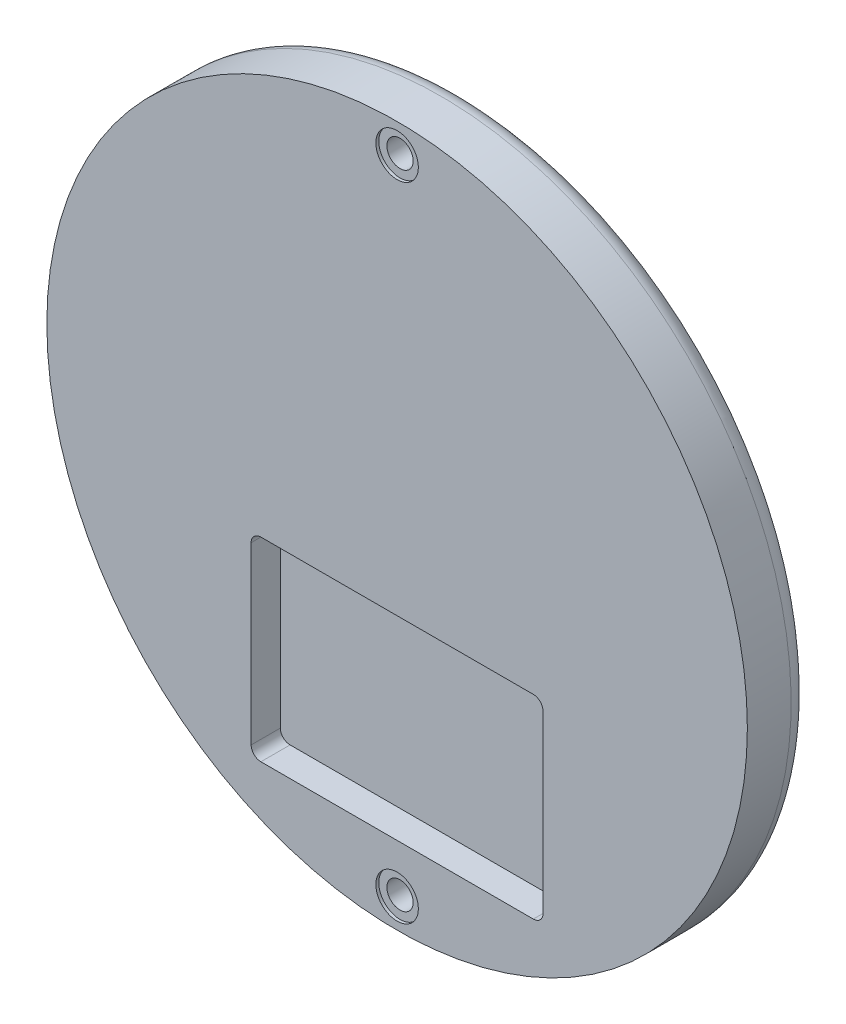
ISO-10303-21;
HEADER;
FILE_DESCRIPTION(('STEP AP214'),'2;1');
FILE_NAME('part.step','',(''),(''),'','','');
FILE_SCHEMA(('AUTOMOTIVE_DESIGN { 1 0 10303 214 1 1 1 1 }'));
ENDSEC;
DATA;
#1=APPLICATION_CONTEXT('core data for automotive mechanical design processes');
#2=APPLICATION_PROTOCOL_DEFINITION('international standard','automotive_design',2000,#1);
#3=PRODUCT_CONTEXT('',#1,'mechanical');
#4=PRODUCT('Part','Part','',(#3));
#5=PRODUCT_RELATED_PRODUCT_CATEGORY('part','',(#4));
#6=PRODUCT_DEFINITION_FORMATION('','',#4);
#7=PRODUCT_DEFINITION_CONTEXT('part definition',#1,'design');
#8=PRODUCT_DEFINITION('design','',#6,#7);
#9=PRODUCT_DEFINITION_SHAPE('','',#8);
#10=(LENGTH_UNIT() NAMED_UNIT(*) SI_UNIT(.MILLI.,.METRE.));
#11=(NAMED_UNIT(*) PLANE_ANGLE_UNIT() SI_UNIT($,.RADIAN.));
#12=(NAMED_UNIT(*) SI_UNIT($,.STERADIAN.) SOLID_ANGLE_UNIT());
#13=UNCERTAINTY_MEASURE_WITH_UNIT(LENGTH_MEASURE(1.E-05),#10,'distance_accuracy_value','');
#14=(GEOMETRIC_REPRESENTATION_CONTEXT(3) GLOBAL_UNCERTAINTY_ASSIGNED_CONTEXT((#13)) GLOBAL_UNIT_ASSIGNED_CONTEXT((#10,
#11,#12)) REPRESENTATION_CONTEXT('',''));
#15=CARTESIAN_POINT('',(0.,0.,0.));
#16=DIRECTION('',(0.,0.,1.));
#17=DIRECTION('',(1.,0.,0.));
#18=AXIS2_PLACEMENT_3D('',#15,#16,#17);
#19=CARTESIAN_POINT('',(0.,33.,0.));
#20=DIRECTION('',(0.,0.,-1.));
#21=DIRECTION('',(-1.,0.,0.));
#22=AXIS2_PLACEMENT_3D('',#19,#20,#21);
#23=CYLINDRICAL_SURFACE('',#22,1.349999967);
#24=CARTESIAN_POINT('',(0.,33.,1.13277999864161));
#25=DIRECTION('',(0.,0.,-1.));
#26=DIRECTION('',(-1.,0.,0.));
#27=AXIS2_PLACEMENT_3D('',#24,#25,#26);
#28=CIRCLE('',#27,1.349999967);
#29=CARTESIAN_POINT('',(-1.349999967,33.,1.13277999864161));
#30=VERTEX_POINT('',#29);
#31=EDGE_CURVE('E197',#30,#30,#28,.T.);
#32=ORIENTED_EDGE('',*,*,#31,.T.);
#33=EDGE_LOOP('',(#32));
#34=FACE_BOUND('',#33,.T.);
#35=CARTESIAN_POINT('',(0.,33.,6.2));
#36=DIRECTION('',(0.,0.,1.));
#37=DIRECTION('',(1.,0.,0.));
#38=AXIS2_PLACEMENT_3D('',#35,#36,#37);
#39=CIRCLE('',#38,1.349999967);
#40=CARTESIAN_POINT('',(1.349999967,33.,6.2));
#41=VERTEX_POINT('',#40);
#42=EDGE_CURVE('E191',#41,#41,#39,.F.);
#43=ORIENTED_EDGE('',*,*,#42,.F.);
#44=EDGE_LOOP('',(#43));
#45=FACE_BOUND('',#44,.T.);
#46=ADVANCED_FACE('F37',(#34,#45),#23,.F.);
#47=CARTESIAN_POINT('',(0.,-33.,0.));
#48=DIRECTION('',(0.,0.,-1.));
#49=DIRECTION('',(-1.,0.,0.));
#50=AXIS2_PLACEMENT_3D('',#47,#48,#49);
#51=CYLINDRICAL_SURFACE('',#50,1.349999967);
#52=CARTESIAN_POINT('',(0.,-33.,1.13277999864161));
#53=DIRECTION('',(0.,0.,-1.));
#54=DIRECTION('',(-1.,0.,0.));
#55=AXIS2_PLACEMENT_3D('',#52,#53,#54);
#56=CIRCLE('',#55,1.349999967);
#57=CARTESIAN_POINT('',(-1.349999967,-33.,1.13277999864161));
#58=VERTEX_POINT('',#57);
#59=EDGE_CURVE('E209',#58,#58,#56,.T.);
#60=ORIENTED_EDGE('',*,*,#59,.T.);
#61=EDGE_LOOP('',(#60));
#62=FACE_BOUND('',#61,.T.);
#63=CARTESIAN_POINT('',(0.,-33.,6.2));
#64=DIRECTION('',(0.,0.,1.));
#65=DIRECTION('',(1.,0.,0.));
#66=AXIS2_PLACEMENT_3D('',#63,#64,#65);
#67=CIRCLE('',#66,1.349999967);
#68=CARTESIAN_POINT('',(1.349999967,-33.,6.2));
#69=VERTEX_POINT('',#68);
#70=EDGE_CURVE('E204',#69,#69,#67,.F.);
#71=ORIENTED_EDGE('',*,*,#70,.F.);
#72=EDGE_LOOP('',(#71));
#73=FACE_BOUND('',#72,.T.);
#74=ADVANCED_FACE('F240',(#62,#73),#51,.F.);
#75=CARTESIAN_POINT('',(0.,0.,6.5));
#76=DIRECTION('',(0.,0.,-1.));
#77=DIRECTION('',(-1.,0.,0.));
#78=AXIS2_PLACEMENT_3D('',#75,#76,#77);
#79=CYLINDRICAL_SURFACE('',#78,36.);
#80=CARTESIAN_POINT('',(0.,0.,2.));
#81=DIRECTION('',(0.,0.,1.));
#82=DIRECTION('',(1.,0.,0.));
#83=AXIS2_PLACEMENT_3D('',#80,#81,#82);
#84=CIRCLE('',#83,36.);
#85=CARTESIAN_POINT('',(-36.,0.,2.));
#86=VERTEX_POINT('',#85);
#87=EDGE_CURVE('E215',#86,#86,#84,.T.);
#88=CARTESIAN_POINT('',(0.,0.,6.5));
#89=DIRECTION('',(0.,0.,1.));
#90=DIRECTION('',(1.,0.,0.));
#91=AXIS2_PLACEMENT_3D('',#88,#89,#90);
#92=CIRCLE('',#91,36.);
#93=CARTESIAN_POINT('',(-36.,0.,6.5));
#94=VERTEX_POINT('',#93);
#95=EDGE_CURVE('E212',#94,#94,#92,.T.);
#96=CARTESIAN_POINT('',(-36.,0.,2.));
#97=CARTESIAN_POINT('',(-36.,0.,2.046875));
#98=CARTESIAN_POINT('',(-36.,0.,2.09375));
#99=CARTESIAN_POINT('',(-36.,0.,2.1875));
#100=CARTESIAN_POINT('',(-36.,0.,2.234375));
#101=CARTESIAN_POINT('',(-36.,0.,2.328125));
#102=CARTESIAN_POINT('',(-36.,0.,2.375));
#103=CARTESIAN_POINT('',(-36.,0.,2.46875));
#104=CARTESIAN_POINT('',(-36.,0.,2.515625));
#105=CARTESIAN_POINT('',(-36.,0.,2.609375));
#106=CARTESIAN_POINT('',(-36.,0.,2.65625));
#107=CARTESIAN_POINT('',(-36.,0.,2.75));
#108=CARTESIAN_POINT('',(-36.,0.,2.796875));
#109=CARTESIAN_POINT('',(-36.,0.,2.890625));
#110=CARTESIAN_POINT('',(-36.,0.,2.9375));
#111=CARTESIAN_POINT('',(-36.,0.,3.03125));
#112=CARTESIAN_POINT('',(-36.,0.,3.078125));
#113=CARTESIAN_POINT('',(-36.,0.,3.171875));
#114=CARTESIAN_POINT('',(-36.,0.,3.21875));
#115=CARTESIAN_POINT('',(-36.,0.,3.3125));
#116=CARTESIAN_POINT('',(-36.,0.,3.359375));
#117=CARTESIAN_POINT('',(-36.,0.,3.453125));
#118=CARTESIAN_POINT('',(-36.,0.,3.5));
#119=CARTESIAN_POINT('',(-36.,0.,3.59375));
#120=CARTESIAN_POINT('',(-36.,0.,3.640625));
#121=CARTESIAN_POINT('',(-36.,0.,3.734375));
#122=CARTESIAN_POINT('',(-36.,0.,3.78125));
#123=CARTESIAN_POINT('',(-36.,0.,3.875));
#124=CARTESIAN_POINT('',(-36.,0.,3.921875));
#125=CARTESIAN_POINT('',(-36.,0.,4.015625));
#126=CARTESIAN_POINT('',(-36.,0.,4.0625));
#127=CARTESIAN_POINT('',(-36.,0.,4.15625));
#128=CARTESIAN_POINT('',(-36.,0.,4.203125));
#129=CARTESIAN_POINT('',(-36.,0.,4.296875));
#130=CARTESIAN_POINT('',(-36.,0.,4.34375));
#131=CARTESIAN_POINT('',(-36.,0.,4.4375));
#132=CARTESIAN_POINT('',(-36.,0.,4.484375));
#133=CARTESIAN_POINT('',(-36.,0.,4.578125));
#134=CARTESIAN_POINT('',(-36.,0.,4.625));
#135=CARTESIAN_POINT('',(-36.,0.,4.71875));
#136=CARTESIAN_POINT('',(-36.,0.,4.765625));
#137=CARTESIAN_POINT('',(-36.,0.,4.859375));
#138=CARTESIAN_POINT('',(-36.,0.,4.90625));
#139=CARTESIAN_POINT('',(-36.,0.,5.));
#140=CARTESIAN_POINT('',(-36.,0.,5.046875));
#141=CARTESIAN_POINT('',(-36.,0.,5.140625));
#142=CARTESIAN_POINT('',(-36.,0.,5.1875));
#143=CARTESIAN_POINT('',(-36.,0.,5.28125));
#144=CARTESIAN_POINT('',(-36.,0.,5.328125));
#145=CARTESIAN_POINT('',(-36.,0.,5.421875));
#146=CARTESIAN_POINT('',(-36.,0.,5.46875));
#147=CARTESIAN_POINT('',(-36.,0.,5.5625));
#148=CARTESIAN_POINT('',(-36.,0.,5.609375));
#149=CARTESIAN_POINT('',(-36.,0.,5.703125));
#150=CARTESIAN_POINT('',(-36.,0.,5.75));
#151=CARTESIAN_POINT('',(-36.,0.,5.84375));
#152=CARTESIAN_POINT('',(-36.,0.,5.890625));
#153=CARTESIAN_POINT('',(-36.,0.,5.984375));
#154=CARTESIAN_POINT('',(-36.,0.,6.03125));
#155=CARTESIAN_POINT('',(-36.,0.,6.125));
#156=CARTESIAN_POINT('',(-36.,0.,6.171875));
#157=CARTESIAN_POINT('',(-36.,0.,6.265625));
#158=CARTESIAN_POINT('',(-36.,0.,6.3125));
#159=CARTESIAN_POINT('',(-36.,0.,6.40625));
#160=CARTESIAN_POINT('',(-36.,0.,6.453125));
#161=CARTESIAN_POINT('',(-36.,0.,6.5));
#162=B_SPLINE_CURVE_WITH_KNOTS('',3,(#96,#97,#98,#99,#100,#101,#102,#103,#104,#105,#106,#107,
#108,#109,#110,#111,#112,#113,#114,#115,#116,#117,#118,#119,#120,#121,#122,#123,#124,#125,#126,
#127,#128,#129,#130,#131,#132,#133,#134,#135,#136,#137,#138,#139,#140,#141,#142,#143,#144,#145,
#146,#147,#148,#149,#150,#151,#152,#153,#154,#155,#156,#157,#158,#159,#160,#161),.UNSPECIFIED.,
.F.,.F.,(4,2,2,2,2,2,2,2,2,2,2,2,2,2,2,2,2,2,2,2,2,2,2,2,2,2,2,2,2,2,2,2,4),(0.,0.140625,
0.28125,0.421875,0.5625,0.703125,0.843749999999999,0.984375,1.125,1.265625,1.40625,1.546875,
1.6875,1.828125,1.96875,2.109375,2.25,2.390625,2.53125,2.671875,2.8125,2.953125,3.09375,
3.234375,3.375,3.515625,3.65625,3.796875,3.9375,4.078125,4.21875,4.359375,4.5),.UNSPECIFIED.);
#163=EDGE_CURVE('BSEAM243',#86,#94,#162,.T.);
#164=ORIENTED_EDGE('',*,*,#87,.T.);
#165=ORIENTED_EDGE('',*,*,#95,.F.);
#166=ORIENTED_EDGE('',*,*,#163,.T.);
#167=ORIENTED_EDGE('',*,*,#163,.F.);
#168=EDGE_LOOP('',(#164,#166,#165,#167));
#169=FACE_BOUND('',#168,.T.);
#170=ADVANCED_FACE('F243',(#169),#79,.T.);
#171=CARTESIAN_POINT('',(0.,0.,6.5));
#172=DIRECTION('',(0.,0.,1.));
#173=DIRECTION('',(1.,0.,0.));
#174=AXIS2_PLACEMENT_3D('',#171,#172,#173);
#175=PLANE('',#174);
#176=CARTESIAN_POINT('',(14.,-9.,6.5));
#177=DIRECTION('',(0.,0.,1.));
#178=DIRECTION('',(-1.,0.,0.));
#179=AXIS2_PLACEMENT_3D('',#176,#177,#178);
#180=CIRCLE('',#179,1.);
#181=CARTESIAN_POINT('',(15.,-9.,6.5));
#182=VERTEX_POINT('',#181);
#183=CARTESIAN_POINT('',(14.,-8.,6.5));
#184=VERTEX_POINT('',#183);
#185=EDGE_CURVE('E57',#182,#184,#180,.T.);
#186=ORIENTED_EDGE('',*,*,#185,.F.);
#187=DIRECTION('',(0.,1.,0.));
#188=VECTOR('',#187,1.);
#189=CARTESIAN_POINT('',(15.,-9.,6.5));
#190=LINE('',#189,#188);
#191=CARTESIAN_POINT('',(15.,-27.,6.5));
#192=VERTEX_POINT('',#191);
#193=EDGE_CURVE('E138',#192,#182,#190,.T.);
#194=ORIENTED_EDGE('',*,*,#193,.F.);
#195=CARTESIAN_POINT('',(14.,-27.,6.5));
#196=DIRECTION('',(0.,0.,1.));
#197=DIRECTION('',(-1.,0.,0.));
#198=AXIS2_PLACEMENT_3D('',#195,#196,#197);
#199=CIRCLE('',#198,1.);
#200=CARTESIAN_POINT('',(14.,-28.,6.5));
#201=VERTEX_POINT('',#200);
#202=EDGE_CURVE('E141',#201,#192,#199,.T.);
#203=ORIENTED_EDGE('',*,*,#202,.F.);
#204=DIRECTION('',(1.,0.,0.));
#205=VECTOR('',#204,1.);
#206=CARTESIAN_POINT('',(14.,-28.,6.5));
#207=LINE('',#206,#205);
#208=CARTESIAN_POINT('',(-14.,-28.,6.5));
#209=VERTEX_POINT('',#208);
#210=EDGE_CURVE('E169',#209,#201,#207,.T.);
#211=ORIENTED_EDGE('',*,*,#210,.F.);
#212=CARTESIAN_POINT('',(-14.,-27.,6.5));
#213=DIRECTION('',(0.,0.,1.));
#214=DIRECTION('',(-1.,0.,0.));
#215=AXIS2_PLACEMENT_3D('',#212,#213,#214);
#216=CIRCLE('',#215,0.999999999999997);
#217=CARTESIAN_POINT('',(-15.,-27.,6.5));
#218=VERTEX_POINT('',#217);
#219=EDGE_CURVE('E166',#218,#209,#216,.T.);
#220=ORIENTED_EDGE('',*,*,#219,.F.);
#221=DIRECTION('',(0.,-1.,0.));
#222=VECTOR('',#221,1.);
#223=CARTESIAN_POINT('',(-15.,-9.00000000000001,6.5));
#224=LINE('',#223,#222);
#225=CARTESIAN_POINT('',(-15.,-9.00000000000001,6.5));
#226=VERTEX_POINT('',#225);
#227=EDGE_CURVE('E163',#226,#218,#224,.T.);
#228=ORIENTED_EDGE('',*,*,#227,.F.);
#229=CARTESIAN_POINT('',(-14.,-9.00000000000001,6.5));
#230=DIRECTION('',(0.,0.,1.));
#231=DIRECTION('',(1.,0.,0.));
#232=AXIS2_PLACEMENT_3D('',#229,#230,#231);
#233=CIRCLE('',#232,1.);
#234=CARTESIAN_POINT('',(-14.,-8.,6.5));
#235=VERTEX_POINT('',#234);
#236=EDGE_CURVE('E160',#235,#226,#233,.T.);
#237=ORIENTED_EDGE('',*,*,#236,.F.);
#238=DIRECTION('',(-1.,0.,0.));
#239=VECTOR('',#238,1.);
#240=CARTESIAN_POINT('',(14.,-8.,6.5));
#241=LINE('',#240,#239);
#242=EDGE_CURVE('E158',#184,#235,#241,.T.);
#243=ORIENTED_EDGE('',*,*,#242,.F.);
#244=EDGE_LOOP('',(#186,#194,#203,#211,#220,#228,#237,#243));
#245=FACE_BOUND('',#244,.T.);
#246=CARTESIAN_POINT('',(0.,33.,6.5));
#247=DIRECTION('',(0.,0.,-1.));
#248=DIRECTION('',(1.,0.,0.));
#249=AXIS2_PLACEMENT_3D('',#246,#247,#248);
#250=CIRCLE('',#249,2.1844);
#251=CARTESIAN_POINT('',(2.1844,33.,6.5));
#252=VERTEX_POINT('',#251);
#253=EDGE_CURVE('E176',#252,#252,#250,.T.);
#254=ORIENTED_EDGE('',*,*,#253,.T.);
#255=EDGE_LOOP('',(#254));
#256=FACE_BOUND('',#255,.T.);
#257=CARTESIAN_POINT('',(0.,-33.,6.5));
#258=DIRECTION('',(0.,0.,1.));
#259=DIRECTION('',(1.,0.,0.));
#260=AXIS2_PLACEMENT_3D('',#257,#258,#259);
#261=CIRCLE('',#260,2.1844);
#262=CARTESIAN_POINT('',(2.1844,-33.,6.5));
#263=VERTEX_POINT('',#262);
#264=EDGE_CURVE('E200',#263,#263,#261,.T.);
#265=ORIENTED_EDGE('',*,*,#264,.F.);
#266=EDGE_LOOP('',(#265));
#267=FACE_BOUND('',#266,.T.);
#268=ORIENTED_EDGE('',*,*,#95,.T.);
#269=EDGE_LOOP('',(#268));
#270=FACE_BOUND('',#269,.T.);
#271=ADVANCED_FACE('F245',(#245,#256,#267,#270),#175,.T.);
#272=CARTESIAN_POINT('',(0.,0.,0.));
#273=DIRECTION('',(0.,0.,1.));
#274=DIRECTION('',(1.,0.,0.));
#275=AXIS2_PLACEMENT_3D('',#272,#273,#274);
#276=PLANE('',#275);
#277=CARTESIAN_POINT('',(0.,33.,0.));
#278=DIRECTION('',(0.,0.,-1.));
#279=DIRECTION('',(-1.,0.,0.));
#280=AXIS2_PLACEMENT_3D('',#277,#278,#279);
#281=CIRCLE('',#280,2.6999946);
#282=CARTESIAN_POINT('',(2.54391301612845,33.9046974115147,0.));
#283=VERTEX_POINT('',#282);
#284=CARTESIAN_POINT('',(-2.54391301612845,33.9046974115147,0.));
#285=VERTEX_POINT('',#284);
#286=EDGE_CURVE('E194',#283,#285,#281,.T.);
#287=ORIENTED_EDGE('',*,*,#286,.F.);
#288=CARTESIAN_POINT('',(0.,0.,0.));
#289=DIRECTION('',(0.,0.,1.));
#290=DIRECTION('',(1.,0.,0.));
#291=AXIS2_PLACEMENT_3D('',#288,#289,#290);
#292=CIRCLE('',#291,34.);
#293=CARTESIAN_POINT('',(2.54391301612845,-33.9046974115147,0.));
#294=VERTEX_POINT('',#293);
#295=EDGE_CURVE('E224',#283,#294,#292,.F.);
#296=ORIENTED_EDGE('',*,*,#295,.T.);
#297=CARTESIAN_POINT('',(0.,-33.,0.));
#298=DIRECTION('',(0.,0.,-1.));
#299=DIRECTION('',(-1.,0.,0.));
#300=AXIS2_PLACEMENT_3D('',#297,#298,#299);
#301=CIRCLE('',#300,2.6999946);
#302=CARTESIAN_POINT('',(-2.54391301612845,-33.9046974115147,0.));
#303=VERTEX_POINT('',#302);
#304=EDGE_CURVE('E207',#303,#294,#301,.T.);
#305=ORIENTED_EDGE('',*,*,#304,.F.);
#306=CARTESIAN_POINT('',(0.,0.,0.));
#307=DIRECTION('',(0.,0.,1.));
#308=DIRECTION('',(1.,0.,0.));
#309=AXIS2_PLACEMENT_3D('',#306,#307,#308);
#310=CIRCLE('',#309,34.);
#311=EDGE_CURVE('E222',#303,#285,#310,.F.);
#312=ORIENTED_EDGE('',*,*,#311,.T.);
#313=EDGE_LOOP('',(#287,#296,#305,#312));
#314=FACE_BOUND('',#313,.T.);
#315=ADVANCED_FACE('F236',(#314),#276,.F.);
#316=CARTESIAN_POINT('',(0.,-33.,0.));
#317=DIRECTION('',(0.,0.,-1.));
#318=DIRECTION('',(-1.,0.,0.));
#319=AXIS2_PLACEMENT_3D('',#316,#317,#318);
#320=CONICAL_SURFACE('',#319,2.6999946,0.872664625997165);
#321=ORIENTED_EDGE('',*,*,#59,.F.);
#322=EDGE_LOOP('',(#321));
#323=FACE_BOUND('',#322,.T.);
#324=ORIENTED_EDGE('',*,*,#304,.T.);
#325=CARTESIAN_POINT('',(2.54391301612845,-33.9046974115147,0.));
#326=CARTESIAN_POINT('',(2.53009613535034,-33.9435643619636,-4.4103825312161E-07));
#327=CARTESIAN_POINT('',(2.51420486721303,-33.9816186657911,0.00106677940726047));
#328=CARTESIAN_POINT('',(2.47885510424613,-34.0558024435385,0.00500918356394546));
#329=CARTESIAN_POINT('',(2.45940756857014,-34.0919374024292,0.0078788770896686));
#330=CARTESIAN_POINT('',(2.39708861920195,-34.1962950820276,0.0186049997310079));
#331=CARTESIAN_POINT('',(2.34978885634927,-34.2616578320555,0.0285986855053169));
#332=CARTESIAN_POINT('',(2.2286065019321,-34.405977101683,0.0563160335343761));
#333=CARTESIAN_POINT('',(2.15122545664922,-34.481629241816,0.0755221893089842));
#334=CARTESIAN_POINT('',(1.98573684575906,-34.6202609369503,0.116871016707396));
#335=CARTESIAN_POINT('',(1.89754813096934,-34.6831338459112,0.139036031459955));
#336=CARTESIAN_POINT('',(1.73572418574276,-34.7835267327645,0.178359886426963));
#337=CARTESIAN_POINT('',(1.6635799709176,-34.8235260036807,0.195462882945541));
#338=CARTESIAN_POINT('',(1.51592582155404,-34.8971635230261,0.228979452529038));
#339=CARTESIAN_POINT('',(1.44041431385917,-34.9307987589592,0.245392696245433));
#340=CARTESIAN_POINT('',(1.28682871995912,-34.99203895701,0.276761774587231));
#341=CARTESIAN_POINT('',(1.20875824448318,-35.0196520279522,0.291719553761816));
#342=CARTESIAN_POINT('',(1.05047167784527,-35.0691877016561,0.319571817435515));
#343=CARTESIAN_POINT('',(0.97025544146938,-35.0911099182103,0.332466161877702));
#344=CARTESIAN_POINT('',(0.805492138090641,-35.1300729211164,0.356020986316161));
#345=CARTESIAN_POINT('',(0.72088925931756,-35.1469304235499,0.3665945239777));
#346=CARTESIAN_POINT('',(0.550430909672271,-35.1748846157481,0.38445435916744));
#347=CARTESIAN_POINT('',(0.464575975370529,-35.1859837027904,0.391742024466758));
#348=CARTESIAN_POINT('',(0.292095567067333,-35.2024942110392,0.402680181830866));
#349=CARTESIAN_POINT('',(0.205470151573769,-35.20790606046,0.406330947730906));
#350=CARTESIAN_POINT('',(0.0319748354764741,-35.2130690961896,0.409812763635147));
#351=CARTESIAN_POINT('',(-0.0548950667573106,-35.2128202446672,0.409643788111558));
#352=CARTESIAN_POINT('',(-0.235226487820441,-35.2064159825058,0.405327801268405));
#353=CARTESIAN_POINT('',(-0.328664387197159,-35.1997937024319,0.400866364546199));
#354=CARTESIAN_POINT('',(-0.51454438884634,-35.1799155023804,0.387760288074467));
#355=CARTESIAN_POINT('',(-0.606986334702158,-35.1666585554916,0.379115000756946));
#356=CARTESIAN_POINT('',(-0.790312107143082,-35.133402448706,0.358117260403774));
#357=CARTESIAN_POINT('',(-0.881194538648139,-35.1133975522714,0.345761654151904));
#358=CARTESIAN_POINT('',(-1.06063481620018,-35.066482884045,0.318028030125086));
#359=CARTESIAN_POINT('',(-1.14919320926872,-35.0395747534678,0.302650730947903));
#360=CARTESIAN_POINT('',(-1.37259012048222,-34.9613154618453,0.260332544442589));
#361=CARTESIAN_POINT('',(-1.50538292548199,-34.9047353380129,0.231758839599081));
#362=CARTESIAN_POINT('',(-1.69650842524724,-34.805251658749,0.187674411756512));
#363=CARTESIAN_POINT('',(-1.75886400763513,-34.7696614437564,0.172778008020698));
#364=CARTESIAN_POINT('',(-1.88029728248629,-34.6932194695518,0.143176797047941));
#365=CARTESIAN_POINT('',(-1.93937677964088,-34.6523706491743,0.128471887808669));
#366=CARTESIAN_POINT('',(-2.06294593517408,-34.5576800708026,0.0975871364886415));
#367=CARTESIAN_POINT('',(-2.12669810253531,-34.5028074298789,0.0815694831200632));
#368=CARTESIAN_POINT('',(-2.24633973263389,-34.3848289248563,0.0523328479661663));
#369=CARTESIAN_POINT('',(-2.30226675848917,-34.3217654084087,0.0391003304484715));
#370=CARTESIAN_POINT('',(-2.39247896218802,-34.2014857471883,0.0197700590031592));
#371=CARTESIAN_POINT('',(-2.42882333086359,-34.1459986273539,0.0127453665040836));
#372=CARTESIAN_POINT('',(-2.49329044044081,-34.0293938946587,0.00284742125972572));
#373=CARTESIAN_POINT('',(-2.52132353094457,-33.9682236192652,1.82059352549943E-05));
#374=CARTESIAN_POINT('',(-2.54391301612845,-33.9046974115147,0.));
#375=B_SPLINE_CURVE_WITH_KNOTS('',3,(#325,#326,#327,#328,#329,#330,#331,#332,#333,#334,#335,
#336,#337,#338,#339,#340,#341,#342,#343,#344,#345,#346,#347,#348,#349,#350,#351,#352,#353,#354,
#355,#356,#357,#358,#359,#360,#361,#362,#363,#364,#365,#366,#367,#368,#369,#370,#371,#372,#373,
#374),.UNSPECIFIED.,.F.,.F.,(4,2,2,2,2,2,2,2,2,2,2,2,2,2,2,2,2,2,2,2,2,2,2,2,4),(0.,
0.123566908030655,0.24675925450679,0.489401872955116,0.81738490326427,1.14800180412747,
1.40042389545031,1.65296517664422,1.90516428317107,2.1573805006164,2.41785297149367,
2.67821691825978,2.93856125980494,3.19890734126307,3.47990082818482,3.76093782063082,
4.04221433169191,4.32342403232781,4.76311860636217,4.9828983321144,5.20255576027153,
5.45879332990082,5.71375526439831,5.91305640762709,6.11443504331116),.UNSPECIFIED.);
#376=EDGE_CURVE('E50',#294,#303,#375,.T.);
#377=ORIENTED_EDGE('',*,*,#376,.T.);
#378=EDGE_LOOP('',(#324,#377));
#379=FACE_BOUND('',#378,.T.);
#380=ADVANCED_FACE('F230',(#323,#379),#320,.F.);
#381=CARTESIAN_POINT('',(0.,-33.,6.2));
#382=DIRECTION('',(0.,0.,1.));
#383=DIRECTION('',(1.,0.,0.));
#384=AXIS2_PLACEMENT_3D('',#381,#382,#383);
#385=PLANE('',#384);
#386=CARTESIAN_POINT('',(0.,-33.,6.2));
#387=DIRECTION('',(0.,0.,1.));
#388=DIRECTION('',(1.,0.,0.));
#389=AXIS2_PLACEMENT_3D('',#386,#387,#388);
#390=CIRCLE('',#389,2.1844);
#391=CARTESIAN_POINT('',(2.1844,-33.,6.2));
#392=VERTEX_POINT('',#391);
#393=EDGE_CURVE('E201',#392,#392,#390,.T.);
#394=ORIENTED_EDGE('',*,*,#393,.T.);
#395=EDGE_LOOP('',(#394));
#396=FACE_BOUND('',#395,.T.);
#397=ORIENTED_EDGE('',*,*,#70,.T.);
#398=EDGE_LOOP('',(#397));
#399=FACE_BOUND('',#398,.T.);
#400=ADVANCED_FACE('F235',(#396,#399),#385,.T.);
#401=CARTESIAN_POINT('',(0.,-33.,6.2));
#402=DIRECTION('',(0.,0.,1.));
#403=DIRECTION('',(1.,0.,0.));
#404=AXIS2_PLACEMENT_3D('',#401,#402,#403);
#405=CYLINDRICAL_SURFACE('',#404,2.1844);
#406=ORIENTED_EDGE('',*,*,#393,.F.);
#407=EDGE_LOOP('',(#406));
#408=FACE_BOUND('',#407,.T.);
#409=ORIENTED_EDGE('',*,*,#264,.T.);
#410=EDGE_LOOP('',(#409));
#411=FACE_BOUND('',#410,.T.);
#412=ADVANCED_FACE('F238',(#408,#411),#405,.F.);
#413=CARTESIAN_POINT('',(0.,33.,0.));
#414=DIRECTION('',(0.,0.,-1.));
#415=DIRECTION('',(-1.,0.,0.));
#416=AXIS2_PLACEMENT_3D('',#413,#414,#415);
#417=CONICAL_SURFACE('',#416,2.6999946,0.872664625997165);
#418=ORIENTED_EDGE('',*,*,#31,.F.);
#419=EDGE_LOOP('',(#418));
#420=FACE_BOUND('',#419,.T.);
#421=ORIENTED_EDGE('',*,*,#286,.T.);
#422=CARTESIAN_POINT('',(-2.54391301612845,33.9046974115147,0.));
#423=CARTESIAN_POINT('',(-2.53009613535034,33.9435643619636,-4.4103825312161E-07));
#424=CARTESIAN_POINT('',(-2.51420486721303,33.9816186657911,0.00106677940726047));
#425=CARTESIAN_POINT('',(-2.47885510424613,34.0558024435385,0.00500918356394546));
#426=CARTESIAN_POINT('',(-2.45940756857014,34.0919374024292,0.0078788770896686));
#427=CARTESIAN_POINT('',(-2.39708861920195,34.1962950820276,0.0186049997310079));
#428=CARTESIAN_POINT('',(-2.34978885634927,34.2616578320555,0.0285986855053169));
#429=CARTESIAN_POINT('',(-2.2286065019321,34.405977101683,0.0563160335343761));
#430=CARTESIAN_POINT('',(-2.15122545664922,34.481629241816,0.0755221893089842));
#431=CARTESIAN_POINT('',(-1.98573684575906,34.6202609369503,0.116871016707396));
#432=CARTESIAN_POINT('',(-1.89754813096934,34.6831338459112,0.139036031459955));
#433=CARTESIAN_POINT('',(-1.73572418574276,34.7835267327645,0.178359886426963));
#434=CARTESIAN_POINT('',(-1.6635799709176,34.8235260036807,0.195462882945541));
#435=CARTESIAN_POINT('',(-1.51592582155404,34.8971635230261,0.228979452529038));
#436=CARTESIAN_POINT('',(-1.44041431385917,34.9307987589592,0.245392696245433));
#437=CARTESIAN_POINT('',(-1.28682871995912,34.99203895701,0.276761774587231));
#438=CARTESIAN_POINT('',(-1.20875824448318,35.0196520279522,0.291719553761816));
#439=CARTESIAN_POINT('',(-1.05047167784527,35.0691877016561,0.319571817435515));
#440=CARTESIAN_POINT('',(-0.97025544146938,35.0911099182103,0.332466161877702));
#441=CARTESIAN_POINT('',(-0.805492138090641,35.1300729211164,0.356020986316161));
#442=CARTESIAN_POINT('',(-0.72088925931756,35.1469304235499,0.3665945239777));
#443=CARTESIAN_POINT('',(-0.550430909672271,35.1748846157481,0.38445435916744));
#444=CARTESIAN_POINT('',(-0.464575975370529,35.1859837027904,0.391742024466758));
#445=CARTESIAN_POINT('',(-0.292095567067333,35.2024942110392,0.402680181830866));
#446=CARTESIAN_POINT('',(-0.205470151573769,35.20790606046,0.406330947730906));
#447=CARTESIAN_POINT('',(-0.0319748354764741,35.2130690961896,0.409812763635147));
#448=CARTESIAN_POINT('',(0.0548950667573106,35.2128202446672,0.409643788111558));
#449=CARTESIAN_POINT('',(0.235226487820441,35.2064159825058,0.405327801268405));
#450=CARTESIAN_POINT('',(0.328664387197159,35.1997937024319,0.400866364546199));
#451=CARTESIAN_POINT('',(0.51454438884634,35.1799155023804,0.387760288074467));
#452=CARTESIAN_POINT('',(0.606986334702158,35.1666585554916,0.379115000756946));
#453=CARTESIAN_POINT('',(0.790312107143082,35.133402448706,0.358117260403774));
#454=CARTESIAN_POINT('',(0.881194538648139,35.1133975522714,0.345761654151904));
#455=CARTESIAN_POINT('',(1.06063481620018,35.066482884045,0.318028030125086));
#456=CARTESIAN_POINT('',(1.14919320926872,35.0395747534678,0.302650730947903));
#457=CARTESIAN_POINT('',(1.37259012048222,34.9613154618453,0.260332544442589));
#458=CARTESIAN_POINT('',(1.50538292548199,34.9047353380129,0.231758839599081));
#459=CARTESIAN_POINT('',(1.69650842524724,34.805251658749,0.187674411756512));
#460=CARTESIAN_POINT('',(1.75886400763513,34.7696614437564,0.172778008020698));
#461=CARTESIAN_POINT('',(1.88029728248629,34.6932194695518,0.143176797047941));
#462=CARTESIAN_POINT('',(1.93937677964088,34.6523706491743,0.128471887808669));
#463=CARTESIAN_POINT('',(2.06294593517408,34.5576800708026,0.0975871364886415));
#464=CARTESIAN_POINT('',(2.12669810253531,34.5028074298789,0.0815694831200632));
#465=CARTESIAN_POINT('',(2.24633973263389,34.3848289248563,0.0523328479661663));
#466=CARTESIAN_POINT('',(2.30226675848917,34.3217654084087,0.0391003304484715));
#467=CARTESIAN_POINT('',(2.39247896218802,34.2014857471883,0.0197700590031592));
#468=CARTESIAN_POINT('',(2.42882333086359,34.1459986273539,0.0127453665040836));
#469=CARTESIAN_POINT('',(2.49329044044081,34.0293938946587,0.00284742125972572));
#470=CARTESIAN_POINT('',(2.52132353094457,33.9682236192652,1.82059352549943E-05));
#471=CARTESIAN_POINT('',(2.54391301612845,33.9046974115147,0.));
#472=B_SPLINE_CURVE_WITH_KNOTS('',3,(#422,#423,#424,#425,#426,#427,#428,#429,#430,#431,#432,
#433,#434,#435,#436,#437,#438,#439,#440,#441,#442,#443,#444,#445,#446,#447,#448,#449,#450,#451,
#452,#453,#454,#455,#456,#457,#458,#459,#460,#461,#462,#463,#464,#465,#466,#467,#468,#469,#470,
#471),.UNSPECIFIED.,.F.,.F.,(4,2,2,2,2,2,2,2,2,2,2,2,2,2,2,2,2,2,2,2,2,2,2,2,4),(0.,
0.123566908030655,0.24675925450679,0.489401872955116,0.81738490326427,1.14800180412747,
1.40042389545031,1.65296517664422,1.90516428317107,2.1573805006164,2.41785297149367,
2.67821691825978,2.93856125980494,3.19890734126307,3.47990082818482,3.76093782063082,
4.04221433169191,4.32342403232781,4.76311860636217,4.9828983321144,5.20255576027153,
5.45879332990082,5.71375526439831,5.91305640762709,6.11443504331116),.UNSPECIFIED.);
#473=EDGE_CURVE('E11',#285,#283,#472,.T.);
#474=ORIENTED_EDGE('',*,*,#473,.T.);
#475=EDGE_LOOP('',(#421,#474));
#476=FACE_BOUND('',#475,.T.);
#477=ADVANCED_FACE('F262',(#420,#476),#417,.F.);
#478=CARTESIAN_POINT('',(0.,33.,6.2));
#479=DIRECTION('',(0.,0.,1.));
#480=DIRECTION('',(1.,0.,0.));
#481=AXIS2_PLACEMENT_3D('',#478,#479,#480);
#482=PLANE('',#481);
#483=CARTESIAN_POINT('',(0.,33.,6.2));
#484=DIRECTION('',(0.,0.,-1.));
#485=DIRECTION('',(1.,0.,0.));
#486=AXIS2_PLACEMENT_3D('',#483,#484,#485);
#487=CIRCLE('',#486,2.1844);
#488=CARTESIAN_POINT('',(2.1844,33.,6.2));
#489=VERTEX_POINT('',#488);
#490=EDGE_CURVE('E188',#489,#489,#487,.T.);
#491=ORIENTED_EDGE('',*,*,#490,.F.);
#492=EDGE_LOOP('',(#491));
#493=FACE_BOUND('',#492,.T.);
#494=ORIENTED_EDGE('',*,*,#42,.T.);
#495=EDGE_LOOP('',(#494));
#496=FACE_BOUND('',#495,.T.);
#497=ADVANCED_FACE('F283',(#493,#496),#482,.T.);
#498=CARTESIAN_POINT('',(0.,33.,6.2));
#499=DIRECTION('',(0.,0.,1.));
#500=DIRECTION('',(1.,0.,0.));
#501=AXIS2_PLACEMENT_3D('',#498,#499,#500);
#502=CYLINDRICAL_SURFACE('',#501,2.1844);
#503=ORIENTED_EDGE('',*,*,#490,.T.);
#504=EDGE_LOOP('',(#503));
#505=FACE_BOUND('',#504,.T.);
#506=ORIENTED_EDGE('',*,*,#253,.F.);
#507=EDGE_LOOP('',(#506));
#508=FACE_BOUND('',#507,.T.);
#509=ADVANCED_FACE('F288',(#505,#508),#502,.F.);
#510=CARTESIAN_POINT('',(0.,0.,2.));
#511=DIRECTION('',(0.,0.,1.));
#512=DIRECTION('',(1.,0.,0.));
#513=AXIS2_PLACEMENT_3D('',#510,#511,#512);
#514=TOROIDAL_SURFACE('',#513,34.,2.);
#515=ORIENTED_EDGE('',*,*,#376,.F.);
#516=ORIENTED_EDGE('',*,*,#295,.F.);
#517=ORIENTED_EDGE('',*,*,#473,.F.);
#518=ORIENTED_EDGE('',*,*,#311,.F.);
#519=EDGE_LOOP('',(#515,#516,#517,#518));
#520=FACE_BOUND('',#519,.T.);
#521=ORIENTED_EDGE('',*,*,#87,.F.);
#522=EDGE_LOOP('',(#521));
#523=FACE_BOUND('',#522,.T.);
#524=ADVANCED_FACE('F39',(#520,#523),#514,.T.);
#525=CARTESIAN_POINT('',(14.,-9.,3.5));
#526=DIRECTION('',(0.,0.,1.));
#527=DIRECTION('',(1.,0.,0.));
#528=AXIS2_PLACEMENT_3D('',#525,#526,#527);
#529=CYLINDRICAL_SURFACE('',#528,1.);
#530=ORIENTED_EDGE('',*,*,#185,.T.);
#531=DIRECTION('',(0.,0.,1.));
#532=VECTOR('',#531,1.);
#533=CARTESIAN_POINT('',(14.,-8.,3.5));
#534=LINE('',#533,#532);
#535=CARTESIAN_POINT('',(14.,-8.,3.5));
#536=VERTEX_POINT('',#535);
#537=EDGE_CURVE('E115',#536,#184,#534,.T.);
#538=ORIENTED_EDGE('',*,*,#537,.F.);
#539=CARTESIAN_POINT('',(14.,-9.,3.5));
#540=DIRECTION('',(0.,0.,1.));
#541=DIRECTION('',(-1.,0.,0.));
#542=AXIS2_PLACEMENT_3D('',#539,#540,#541);
#543=CIRCLE('',#542,1.);
#544=CARTESIAN_POINT('',(15.,-9.,3.5));
#545=VERTEX_POINT('',#544);
#546=EDGE_CURVE('E119',#545,#536,#543,.T.);
#547=ORIENTED_EDGE('',*,*,#546,.F.);
#548=DIRECTION('',(0.,0.,1.));
#549=VECTOR('',#548,1.);
#550=CARTESIAN_POINT('',(15.,-9.,3.5));
#551=LINE('',#550,#549);
#552=EDGE_CURVE('E174',#545,#182,#551,.T.);
#553=ORIENTED_EDGE('',*,*,#552,.T.);
#554=EDGE_LOOP('',(#530,#538,#547,#553));
#555=FACE_BOUND('',#554,.T.);
#556=ADVANCED_FACE('F117',(#555),#529,.F.);
#557=CARTESIAN_POINT('',(15.,-9.,3.5));
#558=DIRECTION('',(1.,0.,0.));
#559=DIRECTION('',(0.,0.,-1.));
#560=AXIS2_PLACEMENT_3D('',#557,#558,#559);
#561=PLANE('',#560);
#562=ORIENTED_EDGE('',*,*,#193,.T.);
#563=ORIENTED_EDGE('',*,*,#552,.F.);
#564=DIRECTION('',(0.,1.,0.));
#565=VECTOR('',#564,1.);
#566=CARTESIAN_POINT('',(15.,-9.,3.5));
#567=LINE('',#566,#565);
#568=CARTESIAN_POINT('',(15.,-27.,3.5));
#569=VERTEX_POINT('',#568);
#570=EDGE_CURVE('E125',#569,#545,#567,.T.);
#571=ORIENTED_EDGE('',*,*,#570,.F.);
#572=DIRECTION('',(0.,0.,1.));
#573=VECTOR('',#572,1.);
#574=CARTESIAN_POINT('',(15.,-27.,3.5));
#575=LINE('',#574,#573);
#576=EDGE_CURVE('E177',#569,#192,#575,.T.);
#577=ORIENTED_EDGE('',*,*,#576,.T.);
#578=EDGE_LOOP('',(#562,#563,#571,#577));
#579=FACE_BOUND('',#578,.T.);
#580=ADVANCED_FACE('F305',(#579),#561,.F.);
#581=CARTESIAN_POINT('',(14.,-27.,3.5));
#582=DIRECTION('',(0.,0.,1.));
#583=DIRECTION('',(1.,0.,0.));
#584=AXIS2_PLACEMENT_3D('',#581,#582,#583);
#585=CYLINDRICAL_SURFACE('',#584,1.);
#586=ORIENTED_EDGE('',*,*,#202,.T.);
#587=ORIENTED_EDGE('',*,*,#576,.F.);
#588=CARTESIAN_POINT('',(14.,-27.,3.5));
#589=DIRECTION('',(0.,0.,1.));
#590=DIRECTION('',(-1.,0.,0.));
#591=AXIS2_PLACEMENT_3D('',#588,#589,#590);
#592=CIRCLE('',#591,1.);
#593=CARTESIAN_POINT('',(14.,-28.,3.5));
#594=VERTEX_POINT('',#593);
#595=EDGE_CURVE('E154',#594,#569,#592,.T.);
#596=ORIENTED_EDGE('',*,*,#595,.F.);
#597=DIRECTION('',(0.,0.,1.));
#598=VECTOR('',#597,1.);
#599=CARTESIAN_POINT('',(14.,-28.,3.5));
#600=LINE('',#599,#598);
#601=EDGE_CURVE('E179',#594,#201,#600,.T.);
#602=ORIENTED_EDGE('',*,*,#601,.T.);
#603=EDGE_LOOP('',(#586,#587,#596,#602));
#604=FACE_BOUND('',#603,.T.);
#605=ADVANCED_FACE('F329',(#604),#585,.F.);
#606=CARTESIAN_POINT('',(14.,-28.,3.5));
#607=DIRECTION('',(0.,-1.,0.));
#608=DIRECTION('',(0.,0.,-1.));
#609=AXIS2_PLACEMENT_3D('',#606,#607,#608);
#610=PLANE('',#609);
#611=ORIENTED_EDGE('',*,*,#210,.T.);
#612=ORIENTED_EDGE('',*,*,#601,.F.);
#613=DIRECTION('',(1.,0.,0.));
#614=VECTOR('',#613,1.);
#615=CARTESIAN_POINT('',(14.,-28.,3.5));
#616=LINE('',#615,#614);
#617=CARTESIAN_POINT('',(-14.,-28.,3.5));
#618=VERTEX_POINT('',#617);
#619=EDGE_CURVE('E151',#618,#594,#616,.T.);
#620=ORIENTED_EDGE('',*,*,#619,.F.);
#621=DIRECTION('',(0.,0.,1.));
#622=VECTOR('',#621,1.);
#623=CARTESIAN_POINT('',(-14.,-28.,3.5));
#624=LINE('',#623,#622);
#625=EDGE_CURVE('E181',#618,#209,#624,.T.);
#626=ORIENTED_EDGE('',*,*,#625,.T.);
#627=EDGE_LOOP('',(#611,#612,#620,#626));
#628=FACE_BOUND('',#627,.T.);
#629=ADVANCED_FACE('F325',(#628),#610,.F.);
#630=CARTESIAN_POINT('',(-14.,-27.,3.5));
#631=DIRECTION('',(0.,0.,1.));
#632=DIRECTION('',(1.,0.,0.));
#633=AXIS2_PLACEMENT_3D('',#630,#631,#632);
#634=CYLINDRICAL_SURFACE('',#633,0.999999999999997);
#635=ORIENTED_EDGE('',*,*,#219,.T.);
#636=ORIENTED_EDGE('',*,*,#625,.F.);
#637=CARTESIAN_POINT('',(-14.,-27.,3.5));
#638=DIRECTION('',(0.,0.,1.));
#639=DIRECTION('',(-1.,0.,0.));
#640=AXIS2_PLACEMENT_3D('',#637,#638,#639);
#641=CIRCLE('',#640,0.999999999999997);
#642=CARTESIAN_POINT('',(-15.,-27.,3.5));
#643=VERTEX_POINT('',#642);
#644=EDGE_CURVE('E148',#643,#618,#641,.T.);
#645=ORIENTED_EDGE('',*,*,#644,.F.);
#646=DIRECTION('',(0.,0.,1.));
#647=VECTOR('',#646,1.);
#648=CARTESIAN_POINT('',(-15.,-27.,3.5));
#649=LINE('',#648,#647);
#650=EDGE_CURVE('E183',#643,#218,#649,.T.);
#651=ORIENTED_EDGE('',*,*,#650,.T.);
#652=EDGE_LOOP('',(#635,#636,#645,#651));
#653=FACE_BOUND('',#652,.T.);
#654=ADVANCED_FACE('F321',(#653),#634,.F.);
#655=CARTESIAN_POINT('',(-15.,-9.00000000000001,3.5));
#656=DIRECTION('',(-1.,0.,0.));
#657=DIRECTION('',(0.,-1.,0.));
#658=AXIS2_PLACEMENT_3D('',#655,#656,#657);
#659=PLANE('',#658);
#660=ORIENTED_EDGE('',*,*,#227,.T.);
#661=ORIENTED_EDGE('',*,*,#650,.F.);
#662=DIRECTION('',(0.,-1.,0.));
#663=VECTOR('',#662,1.);
#664=CARTESIAN_POINT('',(-15.,-9.00000000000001,3.5));
#665=LINE('',#664,#663);
#666=CARTESIAN_POINT('',(-15.,-9.00000000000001,3.5));
#667=VERTEX_POINT('',#666);
#668=EDGE_CURVE('E145',#667,#643,#665,.T.);
#669=ORIENTED_EDGE('',*,*,#668,.F.);
#670=DIRECTION('',(0.,0.,1.));
#671=VECTOR('',#670,1.);
#672=CARTESIAN_POINT('',(-15.,-9.00000000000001,3.5));
#673=LINE('',#672,#671);
#674=EDGE_CURVE('E185',#667,#226,#673,.T.);
#675=ORIENTED_EDGE('',*,*,#674,.T.);
#676=EDGE_LOOP('',(#660,#661,#669,#675));
#677=FACE_BOUND('',#676,.T.);
#678=ADVANCED_FACE('F317',(#677),#659,.F.);
#679=CARTESIAN_POINT('',(-14.,-9.00000000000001,3.5));
#680=DIRECTION('',(0.,0.,1.));
#681=DIRECTION('',(1.,0.,0.));
#682=AXIS2_PLACEMENT_3D('',#679,#680,#681);
#683=CYLINDRICAL_SURFACE('',#682,1.);
#684=ORIENTED_EDGE('',*,*,#236,.T.);
#685=ORIENTED_EDGE('',*,*,#674,.F.);
#686=CARTESIAN_POINT('',(-14.,-9.00000000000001,3.5));
#687=DIRECTION('',(0.,0.,1.));
#688=DIRECTION('',(1.,0.,0.));
#689=AXIS2_PLACEMENT_3D('',#686,#687,#688);
#690=CIRCLE('',#689,1.);
#691=CARTESIAN_POINT('',(-14.,-8.,3.5));
#692=VERTEX_POINT('',#691);
#693=EDGE_CURVE('E133',#692,#667,#690,.T.);
#694=ORIENTED_EDGE('',*,*,#693,.F.);
#695=DIRECTION('',(0.,0.,1.));
#696=VECTOR('',#695,1.);
#697=CARTESIAN_POINT('',(-14.,-8.,3.5));
#698=LINE('',#697,#696);
#699=EDGE_CURVE('E124',#692,#235,#698,.T.);
#700=ORIENTED_EDGE('',*,*,#699,.T.);
#701=EDGE_LOOP('',(#684,#685,#694,#700));
#702=FACE_BOUND('',#701,.T.);
#703=ADVANCED_FACE('F314',(#702),#683,.F.);
#704=CARTESIAN_POINT('',(14.,-8.,3.5));
#705=DIRECTION('',(0.,1.,0.));
#706=DIRECTION('',(-1.,0.,0.));
#707=AXIS2_PLACEMENT_3D('',#704,#705,#706);
#708=PLANE('',#707);
#709=ORIENTED_EDGE('',*,*,#242,.T.);
#710=ORIENTED_EDGE('',*,*,#699,.F.);
#711=DIRECTION('',(-1.,0.,0.));
#712=VECTOR('',#711,1.);
#713=CARTESIAN_POINT('',(14.,-8.,3.5));
#714=LINE('',#713,#712);
#715=EDGE_CURVE('E128',#536,#692,#714,.T.);
#716=ORIENTED_EDGE('',*,*,#715,.F.);
#717=ORIENTED_EDGE('',*,*,#537,.T.);
#718=EDGE_LOOP('',(#709,#710,#716,#717));
#719=FACE_BOUND('',#718,.T.);
#720=ADVANCED_FACE('F129',(#719),#708,.F.);
#721=CARTESIAN_POINT('',(14.,-9.,3.5));
#722=DIRECTION('',(0.,0.,-1.));
#723=DIRECTION('',(-1.,0.,0.));
#724=AXIS2_PLACEMENT_3D('',#721,#722,#723);
#725=PLANE('',#724);
#726=ORIENTED_EDGE('',*,*,#546,.T.);
#727=ORIENTED_EDGE('',*,*,#715,.T.);
#728=ORIENTED_EDGE('',*,*,#693,.T.);
#729=ORIENTED_EDGE('',*,*,#668,.T.);
#730=ORIENTED_EDGE('',*,*,#644,.T.);
#731=ORIENTED_EDGE('',*,*,#619,.T.);
#732=ORIENTED_EDGE('',*,*,#595,.T.);
#733=ORIENTED_EDGE('',*,*,#570,.T.);
#734=EDGE_LOOP('',(#726,#727,#728,#729,#730,#731,#732,#733));
#735=FACE_BOUND('',#734,.T.);
#736=ADVANCED_FACE('F135',(#735),#725,.F.);
#737=CLOSED_SHELL('',(#46,#74,#170,#271,#315,#380,#400,#412,#477,#497,#509,#524,#556,#580,#605,
#629,#654,#678,#703,#720,#736));
#738=MANIFOLD_SOLID_BREP('B2',#737);
#739=ADVANCED_BREP_SHAPE_REPRESENTATION('',(#18,#738),#14);
#740=SHAPE_DEFINITION_REPRESENTATION(#9,#739);
ENDSEC;
END-ISO-10303-21;
